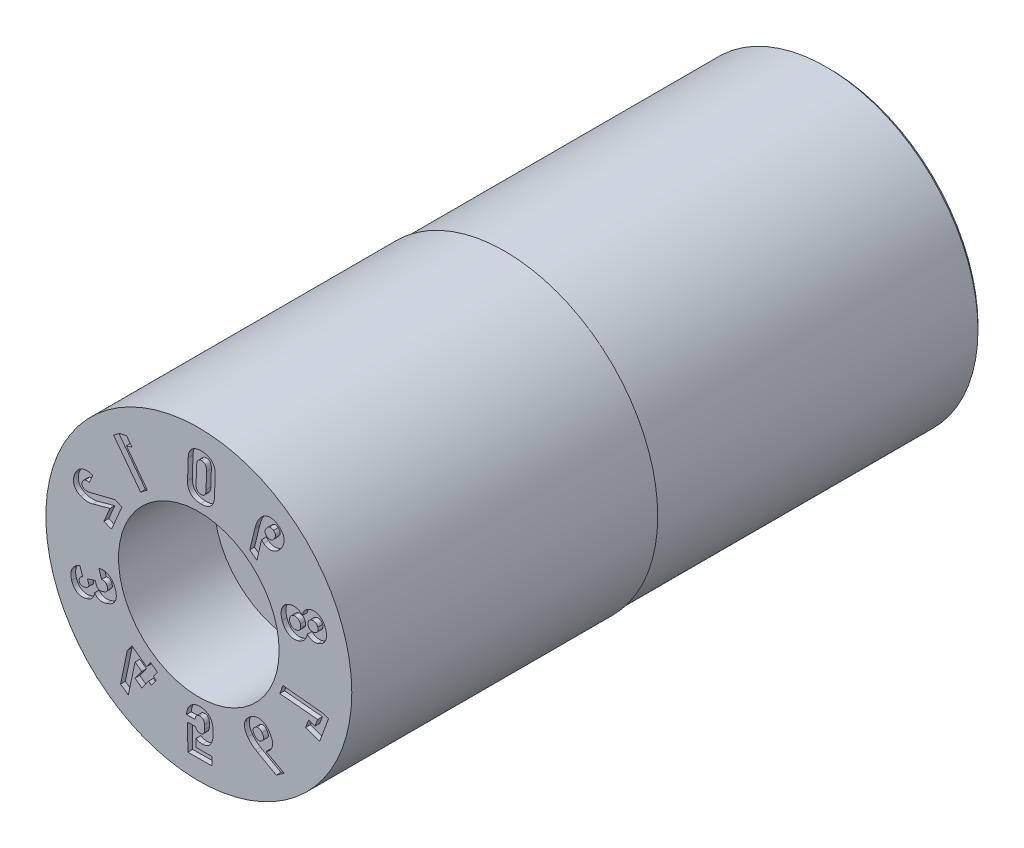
from build123d import *

# Parameters (mm, degrees)
SKETCH4_W          = 17
SKETCH4_H          = 1
CUT_EXTRUDE1_DEPTH = 0.25
CUT_EXTRUDE2_DEPTH = 4


with BuildPart() as part:
    # Sketch1 → Revolve1 (revolve)
    with BuildSketch(Plane(origin=(0, 0, 0), x_dir=(0, 0, -1), z_dir=(1, 0, 0)), mode=Mode.PRIVATE) as revolve1_sk:
        Polygon((0, 8), (0, 4.2), (5, 4.2), (5, 1.75), (25, 1.75), (25, 4), (33, 4), (33, 7.75), (32.75, 8), align=None)
    revolve(revolve1_sk.sketch.rotate(Axis((0, 0, 3.797909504), (0, 0, -1)), 90), axis=Axis((0, 0, 3.797909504), (0, 0, -1)))

    # Sketch4 → Cut-Revolve1 (revolve, cut)
    with BuildSketch(Plane(origin=(0, 0, 0), x_dir=(0, 0, -1), z_dir=(1, 0, 0)), mode=Mode.PRIVATE) as cut_revolve1_sk:
        with Locations((24.5, 8.435)):
            Rectangle(SKETCH4_W, SKETCH4_H)
    revolve(cut_revolve1_sk.sketch.rotate(Axis((0, 0, 0), (0, 0, -1)), 90), axis=Axis((0, 0, 0), (0, 0, -1)), mode=Mode.SUBTRACT)

    # Sketch2 → Cut-Extrude1 (cut)
    # profile 1 of 10: a face of its own
    with BuildSketch(Plane.XY):
        with BuildLine():
            Line((5.210467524, 0.955528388), (5.246810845, 0.967840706))
            add(Edge.make_bspline(
                [(5.246810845, 0.967840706), (5.301753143, 0.985688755), (5.380186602, 1.024554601), (5.471017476, 1.097930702), (5.531689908, 1.162720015), (5.583470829, 1.235133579), (5.639440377, 1.338736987), (5.662193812, 1.424415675), (5.67021212, 1.482195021)],
                knots=[0, 0, 0, 0, 0.246977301, 0.370172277, 0.497924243, 0.625566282, 0.750117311, 1, 1, 1, 1], degree=3))
            add(Edge.make_bspline(
                [(5.67021212, 1.482195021), (5.705164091, 1.446458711), (5.764353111, 1.400243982), (5.853289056, 1.355496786), (5.923357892, 1.331329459), (5.995213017, 1.316539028), (6.090347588, 1.310442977), (6.160594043, 1.322863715), (6.204928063, 1.337469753)],
                knots=[0, 0, 0, 0, 0.257134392, 0.383027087, 0.511099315, 0.63762545, 0.759670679, 1, 1, 1, 1], degree=3))
            Line((6.204928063, 1.337469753), (6.262847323, 1.356996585))
            add(Edge.make_bspline(
                [(6.262847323, 1.356996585), (6.317766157, 1.375844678), (6.396782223, 1.411441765), (6.486640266, 1.480559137), (6.543398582, 1.539814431), (6.591662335, 1.605664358), (6.628619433, 1.678698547), (6.655773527, 1.757243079), (6.67171311, 1.841175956), (6.677740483, 1.929497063), (6.670410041, 2.054892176), (6.647243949, 2.148662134), (6.626841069, 2.210671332)],
                knots=[0, 0, 0, 0, 0.167140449, 0.246141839, 0.32429089, 0.402157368, 0.479801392, 0.558524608, 0.640148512, 0.72448726, 0.81225289, 1, 1, 1, 1], degree=3))
            add(Edge.make_bspline(
                [(6.626841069, 2.210671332), (6.605753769, 2.272630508), (6.568178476, 2.361712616), (6.498667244, 2.466543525), (6.441104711, 2.533715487), (6.377823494, 2.591196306), (6.30902533, 2.637589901), (6.235524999, 2.673483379), (6.157688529, 2.697794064), (6.076543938, 2.710779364), (5.963282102, 2.711571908), (5.878542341, 2.693799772), (5.823431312, 2.675431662)],
                knots=[0, 0, 0, 0, 0.188262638, 0.275658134, 0.360331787, 0.44174499, 0.520455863, 0.597882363, 0.675873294, 0.753814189, 0.833077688, 1, 1, 1, 1], degree=3))
            Line((5.823431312, 2.675431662), (5.765512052, 2.65590483))
            add(Edge.make_bspline(
                [(5.765512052, 2.65590483), (5.720096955, 2.641684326), (5.65675959, 2.607589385), (5.582659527, 2.546131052), (5.534728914, 2.490113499), (5.493216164, 2.428444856), (5.450527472, 2.337965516), (5.43170639, 2.26495238), (5.426166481, 2.214914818)],
                knots=[0, 0, 0, 0, 0.242123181, 0.364086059, 0.49024928, 0.617698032, 0.743096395, 1, 1, 1, 1], degree=3))
            add(Edge.make_bspline(
                [(5.426166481, 2.214914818), (5.38474201, 2.257184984), (5.314070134, 2.312225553), (5.206663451, 2.363213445), (5.121736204, 2.390534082), (5.034478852, 2.406537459), (4.918027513, 2.411246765), (4.831958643, 2.395549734), (4.777189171, 2.37756628)],
                knots=[0, 0, 0, 0, 0.252199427, 0.377454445, 0.505057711, 0.631379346, 0.754394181, 1, 1, 1, 1], degree=3))
            Line((4.777189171, 2.37756628), (4.74084585, 2.365253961))
            add(Edge.make_bspline(
                [(4.74084585, 2.365253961), (4.682399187, 2.34550969), (4.59891326, 2.307189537), (4.503398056, 2.234002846), (4.443164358, 2.171133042), (4.392644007, 2.100753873), (4.353399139, 2.023354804), (4.3255722, 1.939482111), (4.308047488, 1.84997871), (4.302383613, 1.755460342), (4.311174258, 1.621284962), (4.334967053, 1.52077471), (4.357433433, 1.454390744)],
                knots=[0, 0, 0, 0, 0.166585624, 0.245063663, 0.323249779, 0.400569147, 0.477894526, 0.556350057, 0.63817055, 0.723193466, 0.810970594, 1, 1, 1, 1], degree=3))
            add(Edge.make_bspline(
                [(4.357433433, 1.454390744), (4.379741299, 1.387919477), (4.420869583, 1.293224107), (4.494026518, 1.180483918), (4.555507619, 1.10864906), (4.622401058, 1.046492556), (4.695788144, 0.996818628), (4.77353514, 0.958126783), (4.856037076, 0.93211727), (4.941984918, 0.918182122), (5.062199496, 0.916569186), (5.15199613, 0.936447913), (5.210467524, 0.955528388)],
                knots=[0, 0, 0, 0, 0.189148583, 0.276863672, 0.361539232, 0.44357587, 0.522394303, 0.59972543, 0.677021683, 0.754789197, 0.833794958, 1, 1, 1, 1], degree=3))
        make_face()
        with BuildLine():
            Line((4.941220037, 1.966881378), (4.962795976, 1.974095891))
            add(Edge.make_bspline(
                [(4.962795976, 1.974095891), (4.98641959, 1.981999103), (5.022871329, 1.989616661), (5.071458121, 1.988281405), (5.106269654, 1.982349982), (5.13965017, 1.971389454), (5.171353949, 1.955840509), (5.200932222, 1.935642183), (5.228457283, 1.911162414), (5.25297164, 1.881999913), (5.283729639, 1.837210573), (5.29960731, 1.798350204), (5.308789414, 1.771543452)],
                knots=[0, 0, 0, 0, 0.166218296, 0.245090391, 0.322722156, 0.400755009, 0.478423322, 0.557266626, 0.638757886, 0.723096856, 0.810567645, 1, 1, 1, 1], degree=3))
            add(Edge.make_bspline(
                [(5.308789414, 1.771543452), (5.317429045, 1.744590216), (5.327981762, 1.704070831), (5.330589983, 1.649770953), (5.32787862, 1.611649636), (5.321295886, 1.575125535), (5.309483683, 1.540938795), (5.293296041, 1.509284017), (5.272591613, 1.480562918), (5.248115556, 1.45483324), (5.209390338, 1.425031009), (5.175609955, 1.409326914), (5.151822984, 1.401612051)],
                knots=[0, 0, 0, 0, 0.188381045, 0.275513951, 0.359781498, 0.441669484, 0.52114919, 0.598996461, 0.676872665, 0.755389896, 0.833935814, 1, 1, 1, 1], degree=3))
            Line((5.151822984, 1.401612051), (5.128808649, 1.39391657))
            add(Edge.make_bspline(
                [(5.128808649, 1.39391657), (5.10310983, 1.385355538), (5.06391523, 1.376906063), (5.011283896, 1.375974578), (4.973756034, 1.381521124), (4.937853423, 1.391651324), (4.904024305, 1.406620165), (4.872308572, 1.426077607), (4.84375922, 1.451036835), (4.817736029, 1.479666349), (4.787899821, 1.524825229), (4.769860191, 1.562003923), (4.761527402, 1.588871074)],
                knots=[0, 0, 0, 0, 0.173701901, 0.255120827, 0.336326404, 0.416101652, 0.493685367, 0.572898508, 0.653753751, 0.736097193, 0.82027794, 1, 1, 1, 1], degree=3))
            add(Edge.make_bspline(
                [(4.761527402, 1.588871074), (4.752656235, 1.615405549), (4.74322122, 1.656051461), (4.741808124, 1.710384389), (4.744932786, 1.749294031), (4.753747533, 1.786431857), (4.767107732, 1.821415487), (4.785908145, 1.853671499), (4.808780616, 1.883539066), (4.836400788, 1.910270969), (4.879173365, 1.941239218), (4.915322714, 1.958960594), (4.941220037, 1.966881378)],
                knots=[0, 0, 0, 0, 0.178658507, 0.263512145, 0.345804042, 0.426861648, 0.50607112, 0.583710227, 0.664091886, 0.745271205, 0.827853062, 1, 1, 1, 1], degree=3))
        make_face(mode=Mode.SUBTRACT)
        with BuildLine():
            Line((5.888500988, 2.231176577), (5.909693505, 2.23810296))
            add(Edge.make_bspline(
                [(5.909693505, 2.23810296), (5.932010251, 2.24529232), (5.965825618, 2.25321126), (6.010953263, 2.253864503), (6.042850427, 2.25022264), (6.073212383, 2.241642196), (6.10187792, 2.229308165), (6.128681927, 2.213185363), (6.152975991, 2.192545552), (6.175131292, 2.168708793), (6.20178804, 2.131146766), (6.21527384, 2.09850368), (6.223418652, 2.07609571)],
                knots=[0, 0, 0, 0, 0.177306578, 0.259345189, 0.339545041, 0.4186855, 0.496490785, 0.574445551, 0.653742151, 0.736205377, 0.819476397, 1, 1, 1, 1], degree=3))
            add(Edge.make_bspline(
                [(6.223418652, 2.07609571), (6.2305285, 2.053360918), (6.239550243, 2.018911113), (6.240120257, 1.97275612), (6.237150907, 1.940158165), (6.22953656, 1.909217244), (6.218333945, 1.879885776), (6.202320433, 1.852840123), (6.182124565, 1.828256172), (6.15873107, 1.805781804), (6.122091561, 1.77893269), (6.089994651, 1.765358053), (6.06793859, 1.75767646)],
                knots=[0, 0, 0, 0, 0.179778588, 0.264113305, 0.345718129, 0.425073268, 0.502737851, 0.580810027, 0.660046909, 0.741092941, 0.823978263, 1, 1, 1, 1], degree=3))
            Line((6.06793859, 1.75767646), (6.044924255, 1.74998098))
            add(Edge.make_bspline(
                [(6.044924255, 1.74998098), (6.021659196, 1.742405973), (5.986077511, 1.73414204), (5.938572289, 1.732608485), (5.904655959, 1.735444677), (5.872694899, 1.743190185), (5.84232127, 1.754700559), (5.81429495, 1.770716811), (5.788428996, 1.790644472), (5.765129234, 1.814315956), (5.73786288, 1.851853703), (5.723582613, 1.884450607), (5.715760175, 1.906985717)],
                knots=[0, 0, 0, 0, 0.179105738, 0.264698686, 0.346614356, 0.427117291, 0.504294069, 0.583324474, 0.662147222, 0.742310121, 0.825294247, 1, 1, 1, 1], degree=3))
            add(Edge.make_bspline(
                [(5.715760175, 1.906985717), (5.708092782, 1.929565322), (5.700387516, 1.964256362), (5.6999118, 2.010543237), (5.704124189, 2.043530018), (5.713224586, 2.074798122), (5.725838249, 2.104648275), (5.74356257, 2.132166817), (5.764905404, 2.158118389), (5.790880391, 2.180871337), (5.83078186, 2.208300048), (5.864521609, 2.22368215), (5.888500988, 2.231176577)],
                knots=[0, 0, 0, 0, 0.173002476, 0.255063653, 0.33456394, 0.413146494, 0.490488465, 0.568625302, 0.649590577, 0.733328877, 0.818008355, 1, 1, 1, 1], degree=3))
        make_face(mode=Mode.SUBTRACT)
    # profile 2 of 10: a face of its own
    with BuildSketch(Plane.XY):
        Polygon((-2.734268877, -4.185909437), (-3.49937056, -3.623827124), (-3.74053551, -3.95227235), (-4.092498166, -5.655620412), (-3.688728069, -5.952212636), (-3.332251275, -4.276250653), (-2.986913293, -4.529915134), (-3.339094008, -5.009451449), (-2.982415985, -5.271724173), (-2.630102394, -4.79200693), (-2.481603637, -4.901085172), (-2.229149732, -4.556995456), (-2.377476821, -4.44802689), (-2.163224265, -4.156296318), (-2.519902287, -3.894023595), align=None)
    # profile 3 of 10: a face of its own
    with BuildSketch(Plane.XY):
        with BuildLine():
            Line((4.283436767, 4.658065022), (4.284529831, 4.659405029))
            add(Edge.make_bspline(
                [(4.284529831, 4.659405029), (4.326388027, 4.716617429), (4.381322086, 4.804868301), (4.431079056, 4.929707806), (4.453491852, 5.019855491), (4.462716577, 5.108664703), (4.459222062, 5.195477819), (4.441081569, 5.279730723), (4.41047987, 5.361351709), (4.366171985, 5.439693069), (4.288445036, 5.542890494), (4.213332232, 5.608880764), (4.1589876, 5.649487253)],
                knots=[0, 0, 0, 0, 0.187626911, 0.273057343, 0.354400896, 0.432445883, 0.50842211, 0.583130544, 0.659365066, 0.738049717, 0.820287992, 1, 1, 1, 1], degree=3))
            add(Edge.make_bspline(
                [(4.1589876, 5.649487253), (4.104380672, 5.689456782), (4.019412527, 5.741406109), (3.898054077, 5.785264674), (3.809785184, 5.803631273), (3.722154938, 5.808680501), (3.635826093, 5.800561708), (3.551182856, 5.778406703), (3.468789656, 5.74257726), (3.38880377, 5.69398082), (3.282911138, 5.60953944), (3.21373486, 5.530746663), (3.171517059, 5.473061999)],
                knots=[0, 0, 0, 0, 0.178420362, 0.259907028, 0.338646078, 0.414954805, 0.490155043, 0.565992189, 0.644312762, 0.725877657, 0.811700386, 1, 1, 1, 1], degree=3))
            Line((3.171517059, 5.473061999), (3.170741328, 5.472321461))
            add(Edge.make_bspline(
                [(3.170741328, 5.472321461), (3.145695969, 5.439516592), (3.112903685, 5.385454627), (3.07309631, 5.308906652), (3.045245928, 5.24554731), (3.018987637, 5.178104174), (2.98403435, 5.080537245), (2.961675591, 5.00418547), (2.947027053, 4.951843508)],
                knots=[0, 0, 0, 0, 0.216977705, 0.332494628, 0.454245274, 0.581279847, 0.713649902, 1, 1, 1, 1], degree=3))
            add(Edge.make_bspline(
                [(2.947027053, 4.951843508), (2.942866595, 4.936198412), (2.933543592, 4.905630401), (2.925716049, 4.874626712), (2.922876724, 4.859103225)],
                knots=[0, 0, 0, 0, 0.506508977, 1, 1, 1, 1], degree=3))
            Line((2.922876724, 4.859103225), (2.661562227, 3.797139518))
            Line((2.661562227, 3.797139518), (3.039055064, 3.517881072))
            Line((3.039055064, 3.517881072), (3.27906346, 4.569987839))
            add(Edge.make_bspline(
                [(3.27906346, 4.569987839), (3.280325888, 4.568294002), (3.291234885, 4.55384096), (3.325138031, 4.512880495), (3.36525133, 4.480711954), (3.392691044, 4.45921746)],
                knots=[0.563785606, 0.563785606, 0.563785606, 0.563785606, 0.581129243, 0.712435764, 1, 1, 1, 1], degree=3))
            add(Edge.make_bspline(
                [(3.392691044, 4.45921746), (3.437993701, 4.425805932), (3.510822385, 4.384151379), (3.615883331, 4.351461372), (3.695207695, 4.339633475), (3.775211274, 4.339600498), (3.854789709, 4.351389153), (3.933045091, 4.375339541), (4.010073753, 4.410149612), (4.084566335, 4.456473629), (4.182037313, 4.533960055), (4.24444954, 4.606515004), (4.283436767, 4.658065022)],
                knots=[0, 0, 0, 0, 0.164674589, 0.242726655, 0.320503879, 0.398278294, 0.475826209, 0.554827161, 0.636811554, 0.722299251, 0.810667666, 1, 1, 1, 1], degree=3))
        make_face()
        with BuildLine():
            Line((3.540016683, 5.224657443), (3.540968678, 5.226455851))
            add(Edge.make_bspline(
                [(3.540968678, 5.226455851), (3.564142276, 5.258514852), (3.603636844, 5.300686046), (3.666601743, 5.338673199), (3.713732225, 5.354250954), (3.761640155, 5.35907776), (3.828479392, 5.349199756), (3.874450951, 5.32398335), (3.90275387, 5.303167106)],
                knots=[0, 0, 0, 0, 0.283143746, 0.406478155, 0.521910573, 0.635081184, 0.747534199, 1, 1, 1, 1], degree=3))
            add(Edge.make_bspline(
                [(3.90275387, 5.303167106), (3.930761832, 5.28185854), (3.969547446, 5.245429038), (3.997706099, 5.183427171), (4.007347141, 5.135854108), (4.005273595, 5.08609219), (3.987953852, 5.014373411), (3.957268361, 4.96483239), (3.934506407, 4.932564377)],
                knots=[0, 0, 0, 0, 0.252621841, 0.366077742, 0.479140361, 0.594486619, 0.717255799, 1, 1, 1, 1], degree=3))
            Line((3.934506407, 4.932564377), (3.933413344, 4.931224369))
            add(Edge.make_bspline(
                [(3.933413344, 4.931224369), (3.908466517, 4.898985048), (3.869307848, 4.853825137), (3.804668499, 4.814120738), (3.756991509, 4.797152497), (3.708083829, 4.791511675), (3.64062391, 4.802103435), (3.593506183, 4.825813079), (3.565246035, 4.84753094)],
                knots=[0, 0, 0, 0, 0.287026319, 0.410457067, 0.52686691, 0.638520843, 0.751095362, 1, 1, 1, 1], degree=3))
            add(Edge.make_bspline(
                [(3.565246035, 4.84753094), (3.537374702, 4.86862031), (3.499213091, 4.905258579), (3.471724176, 4.967446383), (3.462501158, 5.015781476), (3.464678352, 5.066850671), (3.485558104, 5.140111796), (3.515287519, 5.191770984), (3.540016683, 5.224657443)],
                knots=[0, 0, 0, 0, 0.246661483, 0.358169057, 0.470658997, 0.588070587, 0.712165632, 1, 1, 1, 1], degree=3))
        make_face(mode=Mode.SUBTRACT)
    # profile 4 of 10: a face of its own
    with BuildSketch(Plane.XY):
        with BuildLine():
            Line((0.818299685, 5.251558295), (0.852568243, 6.321059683))
            add(Edge.make_bspline(
                [(0.852568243, 6.321059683), (0.853707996, 6.37104078), (0.852381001, 6.444737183), (0.835434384, 6.538998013), (0.817862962, 6.603828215), (0.794971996, 6.664634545), (0.765641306, 6.720949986), (0.730668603, 6.773056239), (0.689465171, 6.820394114), (0.642963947, 6.863267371), (0.590964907, 6.900931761), (0.533622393, 6.9329187), (0.471417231, 6.960055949), (0.40369392, 6.981327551), (0.303427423, 7.002667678), (0.224708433, 7.01018463), (0.170735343, 7.012101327)],
                knots=[0, 0, 0, 0, 0.135818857, 0.198843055, 0.25932173, 0.31779611, 0.374699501, 0.431160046, 0.487607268, 0.544517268, 0.602364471, 0.661319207, 0.722276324, 0.786130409, 0.853499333, 1, 1, 1, 1], degree=3))
            add(Edge.make_bspline(
                [(0.170735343, 7.012101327), (0.116620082, 7.013390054), (0.037246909, 7.012300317), (-0.064105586, 6.995945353), (-0.133393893, 6.980141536), (-0.197237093, 6.956762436), (-0.256671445, 6.928896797), (-0.310944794, 6.89502815), (-0.359813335, 6.855282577), (-0.40356916, 6.810618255), (-0.442220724, 6.761256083), (-0.474527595, 6.706654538), (-0.502148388, 6.647882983), (-0.523473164, 6.584058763), (-0.546580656, 6.49071079), (-0.552658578, 6.416868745), (-0.554877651, 6.366663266)],
                knots=[0, 0, 0, 0, 0.146922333, 0.214044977, 0.277959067, 0.339182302, 0.397900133, 0.455579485, 0.512066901, 0.56819598, 0.624703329, 0.681512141, 0.739766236, 0.800351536, 0.863565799, 1, 1, 1, 1], degree=3))
            Line((-0.554877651, 6.366663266), (-0.589146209, 5.297161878))
            add(Edge.make_bspline(
                [(-0.589146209, 5.297161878), (-0.590281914, 5.247181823), (-0.588966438, 5.173482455), (-0.572002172, 5.079226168), (-0.55451531, 5.014526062), (-0.531504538, 4.953818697), (-0.501671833, 4.897840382), (-0.466617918, 4.845596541), (-0.425743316, 4.797798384), (-0.379087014, 4.7551152), (-0.327488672, 4.717147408), (-0.270072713, 4.685205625), (-0.207636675, 4.658244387), (-0.139944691, 4.636928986), (-0.039863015, 4.615459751), (0.03872169, 4.608080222), (0.092686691, 4.606120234)],
                knots=[0, 0, 0, 0, 0.135852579, 0.198892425, 0.259386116, 0.317476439, 0.374610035, 0.431084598, 0.487863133, 0.544787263, 0.60228845, 0.661257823, 0.722634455, 0.786504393, 0.853462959, 1, 1, 1, 1], degree=3))
            add(Edge.make_bspline(
                [(0.092686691, 4.606120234), (0.146837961, 4.604688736), (0.226108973, 4.606183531), (0.327703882, 4.62193898), (0.396678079, 4.639353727), (0.46083786, 4.662249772), (0.520159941, 4.690816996), (0.574452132, 4.725124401), (0.623492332, 4.765365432), (0.666908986, 4.810737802), (0.705183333, 4.860608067), (0.738221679, 4.914752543), (0.765510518, 4.973603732), (0.787220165, 5.03694559), (0.808823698, 5.129492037), (0.816879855, 5.201987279), (0.818299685, 5.251558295)],
                knots=[0, 0, 0, 0, 0.147137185, 0.214357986, 0.278606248, 0.339919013, 0.398925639, 0.456934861, 0.513791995, 0.570649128, 0.626987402, 0.684089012, 0.742428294, 0.802686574, 0.865482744, 1, 1, 1, 1], degree=3))
        make_face()
        with BuildLine():
            Line((-0.142233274, 5.396269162), (-0.114938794, 6.239011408))
            add(Edge.make_bspline(
                [(-0.114938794, 6.239011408), (-0.112689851, 6.289525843), (-0.106286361, 6.362452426), (-0.075075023, 6.448779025), (-0.050246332, 6.492281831), (-0.026232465, 6.520738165), (-0.006653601, 6.539295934), (0.015776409, 6.553768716), (0.039467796, 6.56701918), (0.065953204, 6.575683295), (0.105018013, 6.584021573), (0.135781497, 6.58624859), (0.156862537, 6.584979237)],
                knots=[0, 0, 0, 0, 0.304248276, 0.43195801, 0.547131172, 0.601686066, 0.654466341, 0.707867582, 0.761045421, 0.8164911, 0.873820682, 1, 1, 1, 1], degree=3))
            add(Edge.make_bspline(
                [(0.156862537, 6.584979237), (0.178004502, 6.58500021), (0.20834545, 6.580548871), (0.246976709, 6.570269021), (0.272362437, 6.558770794), (0.296268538, 6.5458519), (0.316680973, 6.528574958), (0.3356318, 6.509520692), (0.357573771, 6.479302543), (0.379524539, 6.434411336), (0.404518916, 6.346136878), (0.406287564, 6.273092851), (0.405674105, 6.222431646)],
                knots=[0, 0, 0, 0, 0.126047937, 0.183166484, 0.238632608, 0.292582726, 0.345234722, 0.398051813, 0.453219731, 0.568052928, 0.695198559, 1, 1, 1, 1], degree=3))
            Line((0.405674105, 6.222431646), (0.378379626, 5.3796894))
            add(Edge.make_bspline(
                [(0.378379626, 5.3796894), (0.376525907, 5.329022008), (0.369056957, 5.256399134), (0.339230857, 5.169420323), (0.314063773, 5.126006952), (0.290167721, 5.097248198), (0.270091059, 5.079318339), (0.248166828, 5.063977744), (0.223785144, 5.05207999), (0.197621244, 5.042322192), (0.158333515, 5.034370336), (0.127679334, 5.031879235), (0.106559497, 5.033242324)],
                knots=[0, 0, 0, 0, 0.303868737, 0.432040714, 0.547070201, 0.601557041, 0.654951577, 0.707518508, 0.760989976, 0.816720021, 0.873978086, 1, 1, 1, 1], degree=3))
            add(Edge.make_bspline(
                [(0.106559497, 5.033242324), (0.085685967, 5.034666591), (0.054770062, 5.036838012), (0.01672056, 5.048824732), (-0.00918006, 5.058982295), (-0.032116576, 5.073355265), (-0.053590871, 5.089354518), (-0.0718432, 5.109071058), (-0.093954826, 5.139125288), (-0.115323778, 5.184300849), (-0.141653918, 5.272307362), (-0.142503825, 5.345729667), (-0.142233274, 5.396269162)],
                knots=[0, 0, 0, 0, 0.125945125, 0.183291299, 0.238413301, 0.291967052, 0.344823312, 0.398300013, 0.452118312, 0.567781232, 0.695222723, 1, 1, 1, 1], degree=3))
        make_face(mode=Mode.SUBTRACT)
    # profile 5 of 10: a face of its own
    with BuildSketch(Plane.XY):
        Polygon((-3.044079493, 3.563252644), (-2.690786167, 3.829046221), (-3.789470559, 5.288846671), (-3.496446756, 5.374344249), (-3.77894346, 5.749401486), (-4.153854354, 5.665467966), (-4.455641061, 5.438274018), align=None)
    # profile 6 of 10: a face of its own
    with BuildSketch(Plane.XY):
        with BuildLine():
            Line((-4.391789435, 2.550955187), (-5.681188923, 2.223684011))
            add(Edge.make_bspline(
                [(-5.681188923, 2.223684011), (-5.735698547, 2.209176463), (-5.805345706, 2.200772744), (-5.887047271, 2.205086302), (-5.934534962, 2.212016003), (-5.968392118, 2.221135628), (-5.989149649, 2.230173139)],
                knots=[0, 0, 0, 0, 0.54041727, 0.665290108, 0.783622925, 1, 1, 1, 1], degree=3))
            Line((-5.989149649, 2.230173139), (-5.991867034, 2.231521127))
            add(Edge.make_bspline(
                [(-5.991867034, 2.231521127), (-6.017975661, 2.243170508), (-6.055331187, 2.264953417), (-6.089156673, 2.309089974), (-6.105029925, 2.345849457), (-6.112732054, 2.386597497), (-6.110116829, 2.448583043), (-6.096023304, 2.495166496), (-6.082668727, 2.525948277)],
                knots=[0, 0, 0, 0, 0.24737902, 0.359452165, 0.471474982, 0.587843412, 0.71199585, 1, 1, 1, 1], degree=3))
            add(Edge.make_bspline(
                [(-6.082668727, 2.525948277), (-6.069808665, 2.557140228), (-6.042519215, 2.600101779), (-5.990960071, 2.641734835), (-5.947064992, 2.663487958), (-5.897949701, 2.676425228), (-5.822778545, 2.679191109), (-5.764948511, 2.669711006), (-5.726306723, 2.657303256)],
                knots=[0, 0, 0, 0, 0.240300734, 0.353601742, 0.467625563, 0.586428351, 0.712064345, 1, 1, 1, 1], degree=3))
            Line((-5.726306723, 2.657303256), (-5.724948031, 2.656629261))
            Line((-5.724948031, 2.656629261), (-5.547878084, 3.07433185))
            Line((-5.547878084, 3.07433185), (-5.549236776, 3.075005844))
            add(Edge.make_bspline(
                [(-5.549236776, 3.075005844), (-5.614400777, 3.097449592), (-5.71283805, 3.123249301), (-5.844635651, 3.13224728), (-5.937381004, 3.127418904), (-6.025793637, 3.111021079), (-6.109012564, 3.083026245), (-6.186634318, 3.044077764), (-6.258450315, 2.994370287), (-6.323673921, 2.93402999), (-6.402555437, 2.8382201), (-6.448574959, 2.755059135), (-6.473556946, 2.69598089)],
                knots=[0, 0, 0, 0, 0.185540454, 0.271455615, 0.354225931, 0.434575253, 0.512417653, 0.589477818, 0.667282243, 0.746436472, 0.827564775, 1, 1, 1, 1], degree=3))
            add(Edge.make_bspline(
                [(-6.473556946, 2.69598089), (-6.499579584, 2.633115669), (-6.532335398, 2.538985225), (-6.553023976, 2.412094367), (-6.556328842, 2.324003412), (-6.548670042, 2.240386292), (-6.528901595, 2.161754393), (-6.497826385, 2.088568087), (-6.455836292, 2.020681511), (-6.402446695, 1.959467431), (-6.315747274, 1.883128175), (-6.236538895, 1.841923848), (-6.181496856, 1.817509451)],
                knots=[0, 0, 0, 0, 0.194454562, 0.282717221, 0.366021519, 0.445416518, 0.521556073, 0.596459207, 0.671495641, 0.748380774, 0.827477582, 1, 1, 1, 1], degree=3))
            Line((-6.181496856, 1.817509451), (-6.180138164, 1.816835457))
            add(Edge.make_bspline(
                [(-6.180138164, 1.816835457), (-6.130996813, 1.796432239), (-6.054413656, 1.770766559), (-5.948193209, 1.751722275), (-5.866409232, 1.743439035), (-5.784200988, 1.741843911), (-5.675668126, 1.747242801), (-5.595694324, 1.761978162), (-5.543780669, 1.776112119)],
                knots=[0, 0, 0, 0, 0.24611055, 0.371562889, 0.498178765, 0.625725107, 0.751299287, 1, 1, 1, 1], degree=3))
            Line((-5.543780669, 1.776112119), (-4.645833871, 2.02244961))
            Line((-4.645833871, 2.02244961), (-4.959583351, 1.284166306))
            Line((-4.959583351, 1.284166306), (-4.567349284, 1.117529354))
            Line((-4.567349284, 1.117529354), (-4.024685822, 2.395091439))
            Line((-4.024685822, 2.395091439), (-4.391789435, 2.550955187))
        make_face()
    # profile 7 of 10: a face of its own
    with BuildSketch(Plane.XY):
        with BuildLine():
            Line((-5.23045633, -0.977069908), (-5.086757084, -1.412524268))
            add(Edge.make_bspline(
                [(-5.086757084, -1.412524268), (-5.064073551, -1.408542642), (-5.030190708, -1.40439966), (-4.986174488, -1.407845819), (-4.955674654, -1.413716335), (-4.92728188, -1.423405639), (-4.900554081, -1.435391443), (-4.876605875, -1.451623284), (-4.854808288, -1.470595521), (-4.834648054, -1.49229328), (-4.811944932, -1.527108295), (-4.798077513, -1.555704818), (-4.792000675, -1.576512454)],
                knots=[0, 0, 0, 0, 0.185747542, 0.272260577, 0.35428869, 0.434903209, 0.51313317, 0.589186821, 0.666619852, 0.745334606, 0.826521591, 1, 1, 1, 1], degree=3))
            add(Edge.make_bspline(
                [(-4.792000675, -1.576512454), (-4.780387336, -1.612407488), (-4.769202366, -1.667226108), (-4.778349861, -1.738366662), (-4.796521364, -1.784848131), (-4.823873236, -1.826683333), (-4.87746775, -1.875385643), (-4.92810286, -1.900093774), (-4.964955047, -1.911486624)],
                knots=[0, 0, 0, 0, 0.265367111, 0.38329534, 0.497318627, 0.611999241, 0.730054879, 1, 1, 1, 1], degree=3))
            Line((-4.964955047, -1.911486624), (-5.017779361, -1.928588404))
            add(Edge.make_bspline(
                [(-5.017779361, -1.928588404), (-5.055720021, -1.941049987), (-5.111919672, -1.953736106), (-5.185041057, -1.953195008), (-5.231784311, -1.942467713), (-5.272485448, -1.922656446), (-5.319983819, -1.883927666), (-5.341387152, -1.841415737), (-5.351146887, -1.811924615)],
                knots=[0, 0, 0, 0, 0.299914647, 0.427845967, 0.545479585, 0.656508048, 0.764741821, 1, 1, 1, 1], degree=3))
            Line((-5.351146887, -1.811924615), (-5.413800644, -1.622231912))
            Line((-5.413800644, -1.622231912), (-5.820314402, -1.756339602))
            Line((-5.820314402, -1.756339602), (-5.757660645, -1.946032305))
            add(Edge.make_bspline(
                [(-5.757660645, -1.946032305), (-5.749045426, -1.970154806), (-5.744881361, -2.008594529), (-5.757493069, -2.057885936), (-5.777574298, -2.090832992), (-5.804450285, -2.121690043), (-5.855449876, -2.158635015), (-5.90054959, -2.178812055), (-5.933456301, -2.189333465)],
                knots=[0, 0, 0, 0, 0.226218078, 0.33337852, 0.445244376, 0.565053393, 0.69404338, 1, 1, 1, 1], degree=3))
            Line((-5.933456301, -2.189333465), (-5.9713711, -2.202209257))
            add(Edge.make_bspline(
                [(-5.9713711, -2.202209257), (-6.002177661, -2.212001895), (-6.048448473, -2.223063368), (-6.108496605, -2.218329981), (-6.147325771, -2.207475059), (-6.181202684, -2.188250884), (-6.221280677, -2.152279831), (-6.239509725, -2.114376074), (-6.24829767, -2.088061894)],
                knots=[0, 0, 0, 0, 0.287532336, 0.411515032, 0.528749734, 0.640763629, 0.752688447, 1, 1, 1, 1], degree=3))
            add(Edge.make_bspline(
                [(-6.24829767, -2.088061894), (-6.254370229, -2.069769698), (-6.259777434, -2.041322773), (-6.258402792, -2.003034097), (-6.253870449, -1.97446486), (-6.244445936, -1.946322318), (-6.231790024, -1.918655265), (-6.214520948, -1.892402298), (-6.19456173, -1.866426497), (-6.170352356, -1.841677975), (-6.13118966, -1.810533), (-6.098806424, -1.789555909), (-6.075406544, -1.777359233)],
                knots=[0, 0, 0, 0, 0.148996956, 0.220967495, 0.295264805, 0.371678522, 0.449585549, 0.529694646, 0.613890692, 0.702468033, 0.796389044, 1, 1, 1, 1], degree=3))
            Line((-6.075406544, -1.777359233), (-6.218607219, -1.343337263))
            add(Edge.make_bspline(
                [(-6.218607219, -1.343337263), (-6.280731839, -1.370999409), (-6.370022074, -1.418141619), (-6.471889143, -1.501037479), (-6.536843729, -1.567784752), (-6.590758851, -1.640184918), (-6.633681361, -1.717187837), (-6.665261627, -1.798369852), (-6.685381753, -1.883312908), (-6.694390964, -1.970818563), (-6.690305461, -2.091005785), (-6.671888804, -2.180393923), (-6.652484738, -2.238543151)],
                knots=[0, 0, 0, 0, 0.185256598, 0.272212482, 0.356116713, 0.437850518, 0.516894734, 0.595088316, 0.673897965, 0.753527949, 0.833513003, 1, 1, 1, 1], degree=3))
            add(Edge.make_bspline(
                [(-6.652484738, -2.238543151), (-6.637163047, -2.285418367), (-6.610584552, -2.352762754), (-6.565489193, -2.435291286), (-6.529173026, -2.489806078), (-6.489354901, -2.538182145), (-6.446752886, -2.581397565), (-6.400060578, -2.617988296), (-6.350498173, -2.649410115), (-6.297914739, -2.674343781), (-6.242662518, -2.692830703), (-6.185275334, -2.704940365), (-6.125590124, -2.711123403), (-6.063758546, -2.709678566), (-5.975807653, -2.700655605), (-5.910061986, -2.682777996), (-5.865918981, -2.668962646)],
                knots=[0, 0, 0, 0, 0.145044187, 0.212120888, 0.276185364, 0.337318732, 0.39608617, 0.454226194, 0.511331, 0.568298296, 0.624876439, 0.682232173, 0.740419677, 0.800866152, 0.863745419, 1, 1, 1, 1], degree=3))
            Line((-5.865918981, -2.668962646), (-5.798011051, -2.646289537))
            add(Edge.make_bspline(
                [(-5.798011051, -2.646289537), (-5.748966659, -2.630165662), (-5.678855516, -2.597921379), (-5.600784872, -2.534071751), (-5.551534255, -2.479789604), (-5.511065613, -2.418453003), (-5.470906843, -2.325923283), (-5.456130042, -2.250447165), (-5.453866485, -2.198733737)],
                knots=[0, 0, 0, 0, 0.257595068, 0.378617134, 0.499924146, 0.621249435, 0.742702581, 1, 1, 1, 1], degree=3))
            add(Edge.make_bspline(
                [(-5.453866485, -2.198733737), (-5.4398587, -2.223260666), (-5.414726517, -2.256736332), (-5.376763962, -2.296713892), (-5.346452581, -2.322947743), (-5.313439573, -2.345281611), (-5.27894265, -2.365576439), (-5.241473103, -2.381319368), (-5.202277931, -2.394516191), (-5.161189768, -2.403652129), (-5.118557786, -2.410065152), (-5.074547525, -2.412233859), (-5.02929712, -2.410550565), (-4.982800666, -2.406652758), (-4.917703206, -2.394793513), (-4.868600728, -2.38244828), (-4.835999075, -2.371022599)],
                knots=[0, 0, 0, 0, 0.121016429, 0.179006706, 0.236491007, 0.292715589, 0.349953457, 0.40802493, 0.46685417, 0.527322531, 0.58848818, 0.651774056, 0.716170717, 0.782821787, 0.851909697, 1, 1, 1, 1], degree=3))
            Line((-4.835999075, -2.371022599), (-4.767798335, -2.348729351))
            add(Edge.make_bspline(
                [(-4.767798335, -2.348729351), (-4.707322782, -2.328178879), (-4.620643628, -2.291425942), (-4.520862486, -2.221549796), (-4.458822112, -2.163447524), (-4.406988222, -2.098813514), (-4.366744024, -2.0272983), (-4.337798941, -1.949722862), (-4.320240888, -1.866373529), (-4.314777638, -1.777891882), (-4.322101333, -1.649494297), (-4.345738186, -1.552722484), (-4.367134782, -1.488209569)],
                knots=[0, 0, 0, 0, 0.178009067, 0.259460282, 0.33764277, 0.413675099, 0.488995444, 0.564882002, 0.643112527, 0.725017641, 0.810737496, 1, 1, 1, 1], degree=3))
            add(Edge.make_bspline(
                [(-4.367134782, -1.488209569), (-4.38893578, -1.424141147), (-4.427504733, -1.331443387), (-4.498950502, -1.221578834), (-4.558404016, -1.149720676), (-4.62421891, -1.087283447), (-4.69684472, -1.036189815), (-4.775008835, -0.995507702), (-4.858836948, -0.966641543), (-4.947171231, -0.949314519), (-5.072796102, -0.942959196), (-5.16792805, -0.959616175), (-5.23045633, -0.977069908)],
                knots=[0, 0, 0, 0, 0.181223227, 0.266563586, 0.349546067, 0.430082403, 0.508369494, 0.586203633, 0.664928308, 0.744589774, 0.826146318, 1, 1, 1, 1], degree=3))
        make_face()
    # profile 8 of 10: a face of its own
    with BuildSketch(Plane.XY):
        with BuildLine():
            Line((-0.641932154, -5.309177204), (-0.641905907, -5.310615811))
            Line((-0.641905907, -5.310615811), (-0.198265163, -5.306359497))
            Line((-0.198265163, -5.306359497), (-0.198291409, -5.304920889))
            add(Edge.make_bspline(
                [(-0.198291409, -5.304920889), (-0.195222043, -5.265517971), (-0.183760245, -5.209061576), (-0.152288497, -5.142247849), (-0.122406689, -5.101961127), (-0.087085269, -5.068975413), (-0.030333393, -5.037319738), (0.018347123, -5.027986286), (0.051381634, -5.028378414)],
                knots=[0, 0, 0, 0, 0.286829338, 0.412863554, 0.532789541, 0.648654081, 0.76074236, 1, 1, 1, 1], degree=3))
            add(Edge.make_bspline(
                [(0.051381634, -5.028378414), (0.08643973, -5.02779912), (0.138725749, -5.035474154), (0.19821212, -5.068795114), (0.234464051, -5.102583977), (0.263435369, -5.144892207), (0.291378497, -5.216462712), (0.298196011, -5.276340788), (0.298430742, -5.317924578)],
                knots=[0, 0, 0, 0, 0.244807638, 0.356913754, 0.469344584, 0.586506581, 0.710374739, 1, 1, 1, 1], degree=3))
            Line((0.298430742, -5.317924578), (0.300587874, -5.515040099))
            add(Edge.make_bspline(
                [(0.300587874, -5.515040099), (0.301138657, -5.556538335), (0.295644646, -5.616071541), (0.272017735, -5.688107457), (0.246956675, -5.73062053), (0.215599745, -5.765007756), (0.162872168, -5.79785423), (0.116299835, -5.807449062), (0.084779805, -5.807274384)],
                knots=[0, 0, 0, 0, 0.303506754, 0.432923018, 0.55099589, 0.661755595, 0.769799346, 1, 1, 1, 1], degree=3))
            add(Edge.make_bspline(
                [(0.084779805, -5.807274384), (0.05492358, -5.807960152), (0.011049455, -5.802375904), (-0.043182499, -5.782575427), (-0.078942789, -5.761187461), (-0.110555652, -5.734676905), (-0.14652464, -5.691288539), (-0.164752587, -5.652476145), (-0.172786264, -5.624892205)],
                knots=[0, 0, 0, 0, 0.262654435, 0.385309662, 0.506082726, 0.627837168, 0.747048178, 1, 1, 1, 1], degree=3))
            Line((-0.172786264, -5.624892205), (-0.587166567, -5.629094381))
            Line((-0.587166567, -5.629094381), (-0.574474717, -6.982084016))
            Line((-0.574474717, -6.982084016), (0.68978327, -6.970051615))
            Line((0.68978327, -6.970051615), (0.685824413, -6.542715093))
            Line((0.685824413, -6.542715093), (-0.134792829, -6.55049118))
            Line((-0.134792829, -6.55049118), (-0.138541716, -6.134663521))
            add(Edge.make_bspline(
                [(-0.138541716, -6.134663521), (-0.120594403, -6.151293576), (-0.089580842, -6.173943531), (-0.041757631, -6.196204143), (0.039573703, -6.22603081), (0.112931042, -6.236646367), (0.171280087, -6.236462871)],
                knots=[0, 0, 0, 0, 0.220420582, 0.34277132, 0.474064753, 1, 1, 1, 1], degree=3))
            add(Edge.make_bspline(
                [(0.171280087, -6.236462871), (0.228355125, -6.235776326), (0.312775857, -6.226762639), (0.416096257, -6.188948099), (0.485010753, -6.151643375), (0.546137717, -6.103232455), (0.599614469, -6.045273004), (0.64483571, -5.977432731), (0.682386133, -5.900695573), (0.710567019, -5.814672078), (0.73879561, -5.684720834), (0.743974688, -5.58152687), (0.743749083, -5.510792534)],
                knots=[0, 0, 0, 0, 0.163870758, 0.239866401, 0.313778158, 0.387290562, 0.46207451, 0.538646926, 0.619918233, 0.705915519, 0.797177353, 1, 1, 1, 1], degree=3))
            Line((0.743749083, -5.510792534), (0.741591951, -5.313677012))
            add(Edge.make_bspline(
                [(0.741591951, -5.313677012), (0.741292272, -5.242681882), (0.731572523, -5.139200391), (0.695869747, -5.009666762), (0.659166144, -4.924277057), (0.612747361, -4.847880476), (0.556504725, -4.781287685), (0.491538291, -4.724278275), (0.41742685, -4.677181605), (0.334468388, -4.640965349), (0.209488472, -4.604676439), (0.108986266, -4.597417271), (0.040648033, -4.597807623)],
                knots=[0, 0, 0, 0, 0.187127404, 0.272029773, 0.353068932, 0.431236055, 0.506693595, 0.581837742, 0.658126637, 0.737089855, 0.81956141, 1, 1, 1, 1], degree=3))
            add(Edge.make_bspline(
                [(0.040648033, -4.597807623), (-0.019900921, -4.598233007), (-0.109563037, -4.608682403), (-0.22233703, -4.645265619), (-0.300004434, -4.683003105), (-0.372239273, -4.729608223), (-0.436195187, -4.787335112), (-0.493391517, -4.853647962), (-0.5414758, -4.929821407), (-0.582019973, -5.013744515), (-0.623530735, -5.139513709), (-0.638033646, -5.240259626), (-0.641932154, -5.309177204)],
                knots=[0, 0, 0, 0, 0.16543517, 0.244452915, 0.3228114, 0.400720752, 0.478452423, 0.557333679, 0.639212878, 0.723780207, 0.811352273, 1, 1, 1, 1], degree=3))
        make_face()
    # profile 9 of 10: a face of its own
    with BuildSketch(Plane.XY):
        with BuildLine():
            Line((2.552150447, -4.721944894), (2.553205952, -4.72331468))
            add(Edge.make_bspline(
                [(2.553205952, -4.72331468), (2.578755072, -4.759342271), (2.621288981, -4.811571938), (2.684449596, -4.877631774), (2.792065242, -4.979093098), (2.892628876, -5.053892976), (2.977510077, -5.107890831)],
                knots=[0, 0, 0, 0, 0.22994643, 0.350247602, 0.475808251, 1, 1, 1, 1], degree=3))
            add(Edge.make_bspline(
                [(2.977510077, -5.107890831), (2.992265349, -5.117727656), (3.022327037, -5.135598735), (3.052376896, -5.153502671), (3.067816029, -5.161230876)],
                knots=[0, 0, 0, 0, 0.506803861, 1, 1, 1, 1], degree=3))
            Line((3.067816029, -5.161230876), (4.049666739, -5.711670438))
            Line((4.049666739, -5.711670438), (4.460192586, -5.418677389))
            Line((4.460192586, -5.418677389), (3.517682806, -4.902429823))
            add(Edge.make_bspline(
                [(3.517682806, -4.902429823), (3.544170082, -4.89058708), (3.56930646, -4.87573709), (3.592894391, -4.85889615)],
                knots=[0.7579136, 0.7579136, 0.7579136, 0.7579136, 1, 1, 1, 1], degree=3))
            add(Edge.make_bspline(
                [(3.592894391, -4.85889615), (3.642181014, -4.823535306), (3.710384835, -4.764994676), (3.77907158, -4.671170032), (3.8182729, -4.599230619), (3.844397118, -4.523083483), (3.858392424, -4.443780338), (3.859939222, -4.361562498), (3.849117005, -4.276809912), (3.825570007, -4.190304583), (3.777371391, -4.068984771), (3.724943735, -3.982455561), (3.684614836, -3.926391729)],
                knots=[0, 0, 0, 0, 0.171478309, 0.250462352, 0.326796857, 0.401631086, 0.476416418, 0.552979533, 0.632619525, 0.716514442, 0.805115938, 1, 1, 1, 1], degree=3))
            Line((3.684614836, -3.926391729), (3.683559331, -3.925021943))
            add(Edge.make_bspline(
                [(3.683559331, -3.925021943), (3.641889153, -3.867867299), (3.57572817, -3.787644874), (3.471809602, -3.702431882), (3.393079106, -3.653001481), (3.311085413, -3.617004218), (3.227177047, -3.593987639), (3.141188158, -3.584495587), (3.053734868, -3.588665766), (2.965150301, -3.606615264), (2.842350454, -3.648266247), (2.756604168, -3.700550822), (2.70082126, -3.739343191)],
                knots=[0, 0, 0, 0, 0.187035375, 0.272208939, 0.353663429, 0.43158015, 0.507658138, 0.582381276, 0.658921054, 0.737724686, 0.820163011, 1, 1, 1, 1], degree=3))
            add(Edge.make_bspline(
                [(2.70082126, -3.739343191), (2.645126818, -3.778379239), (2.569746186, -3.843759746), (2.489095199, -3.944818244), (2.443910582, -4.022706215), (2.411191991, -4.103735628), (2.391290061, -4.18745265), (2.385524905, -4.273691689), (2.392609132, -4.361842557), (2.412940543, -4.45151816), (2.458721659, -4.576401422), (2.511736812, -4.66466399), (2.552150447, -4.721944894)],
                knots=[0, 0, 0, 0, 0.180655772, 0.263129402, 0.342418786, 0.418979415, 0.49449403, 0.569997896, 0.647620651, 0.728611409, 0.813506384, 1, 1, 1, 1], degree=3))
        make_face()
        with BuildLine():
            Line((3.304989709, -4.160979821), (3.306045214, -4.162349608))
            add(Edge.make_bspline(
                [(3.306045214, -4.162349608), (3.330403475, -4.198047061), (3.363544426, -4.252094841), (3.382933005, -4.329539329), (3.386504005, -4.382122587), (3.377508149, -4.431957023), (3.348705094, -4.495041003), (3.31089905, -4.533157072), (3.281529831, -4.553545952)],
                knots=[0, 0, 0, 0, 0.294014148, 0.419808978, 0.536102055, 0.64742151, 0.758084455, 1, 1, 1, 1], degree=3))
            add(Edge.make_bspline(
                [(3.281529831, -4.553545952), (3.25276446, -4.573978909), (3.205044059, -4.59773469), (3.136158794, -4.603332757), (3.086111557, -4.594721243), (3.036638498, -4.574703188), (2.970163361, -4.529963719), (2.929045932, -4.482141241), (2.903898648, -4.447038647)],
                knots=[0, 0, 0, 0, 0.239770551, 0.349150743, 0.461940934, 0.579886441, 0.707249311, 1, 1, 1, 1], degree=3))
            Line((2.903898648, -4.447038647), (2.902843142, -4.445668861))
            add(Edge.make_bspline(
                [(2.902843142, -4.445668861), (2.881179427, -4.415058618), (2.853247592, -4.367116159), (2.839593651, -4.297998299), (2.84001149, -4.250023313), (2.852053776, -4.2042807), (2.883042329, -4.144914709), (2.921790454, -4.109679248), (2.950104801, -4.089004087)],
                knots=[0, 0, 0, 0, 0.277054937, 0.397337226, 0.513039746, 0.625908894, 0.741003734, 1, 1, 1, 1], degree=3))
            add(Edge.make_bspline(
                [(2.950104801, -4.089004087), (2.979014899, -4.068538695), (3.025280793, -4.043170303), (3.092240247, -4.032974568), (3.139708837, -4.037363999), (3.185754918, -4.052343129), (3.245874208, -4.089526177), (3.283293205, -4.130043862), (3.304989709, -4.160979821)],
                knots=[0, 0, 0, 0, 0.259699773, 0.374848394, 0.488722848, 0.604065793, 0.724491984, 1, 1, 1, 1], degree=3))
        make_face(mode=Mode.SUBTRACT)
    # profile 10 of 10: a face of its own
    with BuildSketch(Plane.XY):
        Polygon((6.50661518, -1.687198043), (4.399136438, -1.4728654), (4.234076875, -1.922415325), (6.21148355, -2.106100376), (6.072310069, -2.484485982), (5.740605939, -2.362971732), (5.588416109, -2.778136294), (6.319553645, -3.046648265), (6.78189939, -1.788438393), align=None)
    extrude(amount=-CUT_EXTRUDE1_DEPTH, mode=Mode.SUBTRACT)

    # Sketch3 → Cut-Extrude2 (cut)
    with BuildSketch(Plane.XY.offset(-5)):
        Polygon((1.010362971, 1.75), (-1.010362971, 1.75), (-2.020725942, 0), (-1.010362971, -1.75), (1.010362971, -1.75), (2.020725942, 0), align=None)
    extrude(amount=-CUT_EXTRUDE2_DEPTH, mode=Mode.SUBTRACT)


solid = part.part
